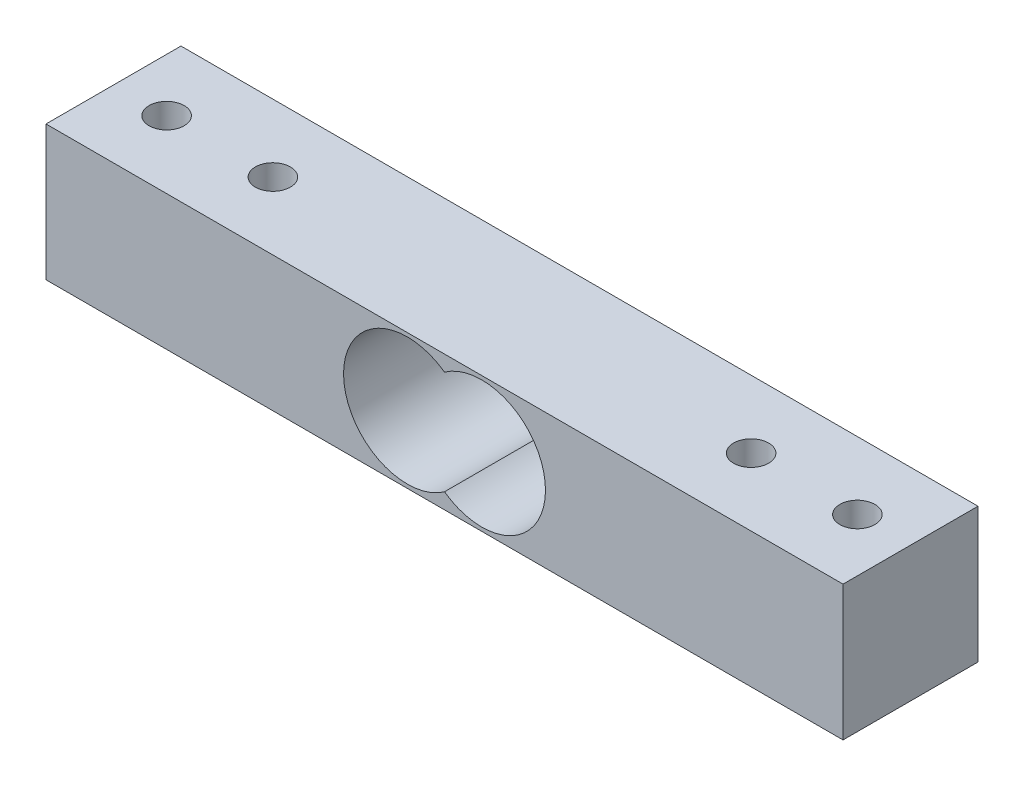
from build123d import *

# Parameters (mm, degrees)
SKETCH_1_W          = 75
SKETCH_1_H          = 12.7
EXTRUDE_1_DEPTH     = 12.7
CUT_EXTRUDE_1_DEPTH = 42.579201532
HOLE_WIZARD_M4_1_D  = 3.3


with BuildPart() as part:
    # Sketch 1 → Extrude 1 (new body)
    with BuildSketch(Plane(origin=(0, 0, 0), x_dir=(1, 0, 0), z_dir=(0, 1, 0))):
        Rectangle(SKETCH_1_W, SKETCH_1_H)
    extrude(amount=-EXTRUDE_1_DEPTH)

    # Sketch 14 → Cut-Extrude 1 (cut, through all)
    with BuildSketch(Plane(origin=(0, 0, -6.35), x_dir=(-1, 0, 0), z_dir=(0, 0, -1))):
        with BuildLine():
            ThreePointArc((0, -1.476602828), (-9.5, -6.35), (0, -11.223397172))
            ThreePointArc((0, -11.223397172), (9.5, -6.35), (0, -1.476602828))
        make_face()
    extrude(amount=-CUT_EXTRUDE_1_DEPTH, mode=Mode.SUBTRACT)

    # Hole Wizard M4 _1 (through all)
    with Locations(Plane(origin=(0, 0, 0), x_dir=(1, 0, 0), z_dir=(0, 1, 0))):
        with Locations((-32.5, 0), (-22.5, 0), (22.5, 0), (32.5, 0)):
            Hole(HOLE_WIZARD_M4_1_D / 2)


solid = part.part
